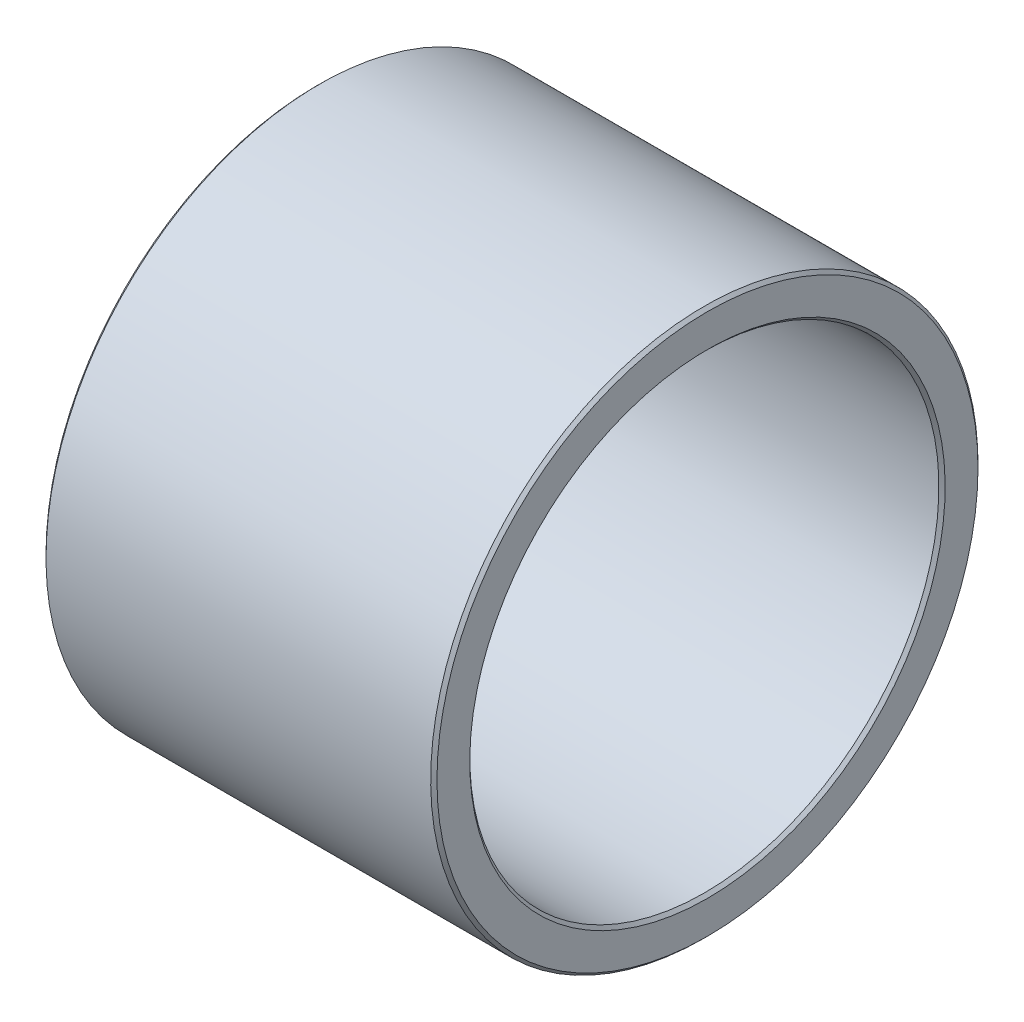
ISO-10303-21;
HEADER;
FILE_DESCRIPTION(('STEP AP214'),'2;1');
FILE_NAME('part.step','',(''),(''),'','','');
FILE_SCHEMA(('AUTOMOTIVE_DESIGN { 1 0 10303 214 1 1 1 1 }'));
ENDSEC;
DATA;
#1=APPLICATION_CONTEXT('core data for automotive mechanical design processes');
#2=APPLICATION_PROTOCOL_DEFINITION('international standard','automotive_design',2000,#1);
#3=PRODUCT_CONTEXT('',#1,'mechanical');
#4=PRODUCT('Part','Part','',(#3));
#5=PRODUCT_RELATED_PRODUCT_CATEGORY('part','',(#4));
#6=PRODUCT_DEFINITION_FORMATION('','',#4);
#7=PRODUCT_DEFINITION_CONTEXT('part definition',#1,'design');
#8=PRODUCT_DEFINITION('design','',#6,#7);
#9=PRODUCT_DEFINITION_SHAPE('','',#8);
#10=(LENGTH_UNIT() NAMED_UNIT(*) SI_UNIT(.MILLI.,.METRE.));
#11=(NAMED_UNIT(*) PLANE_ANGLE_UNIT() SI_UNIT($,.RADIAN.));
#12=(NAMED_UNIT(*) SI_UNIT($,.STERADIAN.) SOLID_ANGLE_UNIT());
#13=UNCERTAINTY_MEASURE_WITH_UNIT(LENGTH_MEASURE(1.E-05),#10,'distance_accuracy_value','');
#14=(GEOMETRIC_REPRESENTATION_CONTEXT(3) GLOBAL_UNCERTAINTY_ASSIGNED_CONTEXT((#13)) GLOBAL_UNIT_ASSIGNED_CONTEXT((#10,
#11,#12)) REPRESENTATION_CONTEXT('',''));
#15=CARTESIAN_POINT('',(0.,0.,0.));
#16=DIRECTION('',(0.,0.,1.));
#17=DIRECTION('',(1.,0.,0.));
#18=AXIS2_PLACEMENT_3D('',#15,#16,#17);
#19=CARTESIAN_POINT('',(0.,-32.5,0.));
#20=DIRECTION('',(-1.,0.,0.));
#21=DIRECTION('',(0.,1.,0.));
#22=AXIS2_PLACEMENT_3D('',#19,#20,#21);
#23=PLANE('',#22);
#24=CARTESIAN_POINT('',(0.,0.,0.));
#25=DIRECTION('',(1.,0.,0.));
#26=DIRECTION('',(0.,-1.,0.));
#27=AXIS2_PLACEMENT_3D('',#24,#25,#26);
#28=CIRCLE('',#27,30.4);
#29=CARTESIAN_POINT('',(0.,-30.4,0.));
#30=VERTEX_POINT('',#29);
#31=EDGE_CURVE('E9',#30,#30,#28,.T.);
#32=ORIENTED_EDGE('',*,*,#31,.T.);
#33=EDGE_LOOP('',(#32));
#34=FACE_BOUND('',#33,.T.);
#35=CARTESIAN_POINT('',(0.,0.,0.));
#36=DIRECTION('',(1.,0.,0.));
#37=DIRECTION('',(0.,-1.,0.));
#38=AXIS2_PLACEMENT_3D('',#35,#36,#37);
#39=CIRCLE('',#38,34.6);
#40=CARTESIAN_POINT('',(0.,-34.6,0.));
#41=VERTEX_POINT('',#40);
#42=EDGE_CURVE('E53',#41,#41,#39,.T.);
#43=ORIENTED_EDGE('',*,*,#42,.F.);
#44=EDGE_LOOP('',(#43));
#45=FACE_BOUND('',#44,.T.);
#46=ADVANCED_FACE('F15',(#34,#45),#23,.T.);
#47=CARTESIAN_POINT('',(0.2,0.,0.));
#48=DIRECTION('',(-1.,0.,0.));
#49=DIRECTION('',(0.,-1.,0.));
#50=AXIS2_PLACEMENT_3D('',#47,#48,#49);
#51=CONICAL_SURFACE('',#50,30.2,0.78539816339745);
#52=CARTESIAN_POINT('',(0.4,0.,0.));
#53=DIRECTION('',(1.,0.,0.));
#54=DIRECTION('',(0.,-1.,0.));
#55=AXIS2_PLACEMENT_3D('',#52,#53,#54);
#56=CIRCLE('',#55,30.);
#57=CARTESIAN_POINT('',(0.4,-30.,0.));
#58=VERTEX_POINT('',#57);
#59=EDGE_CURVE('E22',#58,#58,#56,.T.);
#60=ORIENTED_EDGE('',*,*,#59,.T.);
#61=EDGE_LOOP('',(#60));
#62=FACE_BOUND('',#61,.T.);
#63=ORIENTED_EDGE('',*,*,#31,.F.);
#64=EDGE_LOOP('',(#63));
#65=FACE_BOUND('',#64,.T.);
#66=ADVANCED_FACE('F82',(#62,#65),#51,.F.);
#67=CARTESIAN_POINT('',(25.,0.,0.));
#68=DIRECTION('',(-1.,0.,0.));
#69=DIRECTION('',(0.,-1.,0.));
#70=AXIS2_PLACEMENT_3D('',#67,#68,#69);
#71=CYLINDRICAL_SURFACE('',#70,30.);
#72=CARTESIAN_POINT('',(49.6,0.,0.));
#73=DIRECTION('',(1.,0.,0.));
#74=DIRECTION('',(0.,-1.,0.));
#75=AXIS2_PLACEMENT_3D('',#72,#73,#74);
#76=CIRCLE('',#75,30.);
#77=CARTESIAN_POINT('',(49.6,-30.,0.));
#78=VERTEX_POINT('',#77);
#79=EDGE_CURVE('E58',#78,#78,#76,.T.);
#80=ORIENTED_EDGE('',*,*,#79,.T.);
#81=EDGE_LOOP('',(#80));
#82=FACE_BOUND('',#81,.T.);
#83=ORIENTED_EDGE('',*,*,#59,.F.);
#84=EDGE_LOOP('',(#83));
#85=FACE_BOUND('',#84,.T.);
#86=ADVANCED_FACE('F66',(#82,#85),#71,.F.);
#87=CARTESIAN_POINT('',(49.8,0.,0.));
#88=DIRECTION('',(1.,0.,0.));
#89=DIRECTION('',(0.,-1.,0.));
#90=AXIS2_PLACEMENT_3D('',#87,#88,#89);
#91=CONICAL_SURFACE('',#90,30.2,0.785398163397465);
#92=CARTESIAN_POINT('',(50.,0.,0.));
#93=DIRECTION('',(1.,0.,0.));
#94=DIRECTION('',(0.,-1.,0.));
#95=AXIS2_PLACEMENT_3D('',#92,#93,#94);
#96=CIRCLE('',#95,30.4);
#97=CARTESIAN_POINT('',(50.,-30.4,0.));
#98=VERTEX_POINT('',#97);
#99=EDGE_CURVE('E63',#98,#98,#96,.T.);
#100=ORIENTED_EDGE('',*,*,#99,.T.);
#101=EDGE_LOOP('',(#100));
#102=FACE_BOUND('',#101,.T.);
#103=ORIENTED_EDGE('',*,*,#79,.F.);
#104=EDGE_LOOP('',(#103));
#105=FACE_BOUND('',#104,.T.);
#106=ADVANCED_FACE('F69',(#102,#105),#91,.F.);
#107=CARTESIAN_POINT('',(50.,-32.5,0.));
#108=DIRECTION('',(1.,0.,0.));
#109=DIRECTION('',(0.,-1.,0.));
#110=AXIS2_PLACEMENT_3D('',#107,#108,#109);
#111=PLANE('',#110);
#112=CARTESIAN_POINT('',(50.,0.,0.));
#113=DIRECTION('',(1.,0.,0.));
#114=DIRECTION('',(0.,-1.,0.));
#115=AXIS2_PLACEMENT_3D('',#112,#113,#114);
#116=CIRCLE('',#115,34.6);
#117=CARTESIAN_POINT('',(50.,-34.6,0.));
#118=VERTEX_POINT('',#117);
#119=EDGE_CURVE('E61',#118,#118,#116,.T.);
#120=ORIENTED_EDGE('',*,*,#119,.T.);
#121=EDGE_LOOP('',(#120));
#122=FACE_BOUND('',#121,.T.);
#123=ORIENTED_EDGE('',*,*,#99,.F.);
#124=EDGE_LOOP('',(#123));
#125=FACE_BOUND('',#124,.T.);
#126=ADVANCED_FACE('F71',(#122,#125),#111,.T.);
#127=CARTESIAN_POINT('',(49.8,0.,0.));
#128=DIRECTION('',(-1.,0.,0.));
#129=DIRECTION('',(0.,-1.,0.));
#130=AXIS2_PLACEMENT_3D('',#127,#128,#129);
#131=CONICAL_SURFACE('',#130,34.8,0.785398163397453);
#132=CARTESIAN_POINT('',(49.6,0.,0.));
#133=DIRECTION('',(1.,0.,0.));
#134=DIRECTION('',(0.,-1.,0.));
#135=AXIS2_PLACEMENT_3D('',#132,#133,#134);
#136=CIRCLE('',#135,35.);
#137=CARTESIAN_POINT('',(49.6,-35.,0.));
#138=VERTEX_POINT('',#137);
#139=EDGE_CURVE('E55',#138,#138,#136,.T.);
#140=ORIENTED_EDGE('',*,*,#139,.T.);
#141=EDGE_LOOP('',(#140));
#142=FACE_BOUND('',#141,.T.);
#143=ORIENTED_EDGE('',*,*,#119,.F.);
#144=EDGE_LOOP('',(#143));
#145=FACE_BOUND('',#144,.T.);
#146=ADVANCED_FACE('F79',(#142,#145),#131,.T.);
#147=CARTESIAN_POINT('',(25.,0.,0.));
#148=DIRECTION('',(-1.,0.,0.));
#149=DIRECTION('',(0.,-1.,0.));
#150=AXIS2_PLACEMENT_3D('',#147,#148,#149);
#151=CYLINDRICAL_SURFACE('',#150,35.);
#152=CARTESIAN_POINT('',(0.4,0.,0.));
#153=DIRECTION('',(1.,0.,0.));
#154=DIRECTION('',(0.,-1.,0.));
#155=AXIS2_PLACEMENT_3D('',#152,#153,#154);
#156=CIRCLE('',#155,35.);
#157=CARTESIAN_POINT('',(0.4,-35.,0.));
#158=VERTEX_POINT('',#157);
#159=EDGE_CURVE('E49',#158,#158,#156,.T.);
#160=ORIENTED_EDGE('',*,*,#159,.T.);
#161=EDGE_LOOP('',(#160));
#162=FACE_BOUND('',#161,.T.);
#163=ORIENTED_EDGE('',*,*,#139,.F.);
#164=EDGE_LOOP('',(#163));
#165=FACE_BOUND('',#164,.T.);
#166=ADVANCED_FACE('F50',(#162,#165),#151,.T.);
#167=CARTESIAN_POINT('',(0.2,0.,0.));
#168=DIRECTION('',(1.,0.,0.));
#169=DIRECTION('',(0.,-1.,0.));
#170=AXIS2_PLACEMENT_3D('',#167,#168,#169);
#171=CONICAL_SURFACE('',#170,34.8,0.78539816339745);
#172=ORIENTED_EDGE('',*,*,#42,.T.);
#173=EDGE_LOOP('',(#172));
#174=FACE_BOUND('',#173,.T.);
#175=ORIENTED_EDGE('',*,*,#159,.F.);
#176=EDGE_LOOP('',(#175));
#177=FACE_BOUND('',#176,.T.);
#178=ADVANCED_FACE('F92',(#174,#177),#171,.T.);
#179=CLOSED_SHELL('',(#46,#66,#86,#106,#126,#146,#166,#178));
#180=MANIFOLD_SOLID_BREP('B1',#179);
#181=ADVANCED_BREP_SHAPE_REPRESENTATION('',(#18,#180),#14);
#182=SHAPE_DEFINITION_REPRESENTATION(#9,#181);
ENDSEC;
END-ISO-10303-21;
